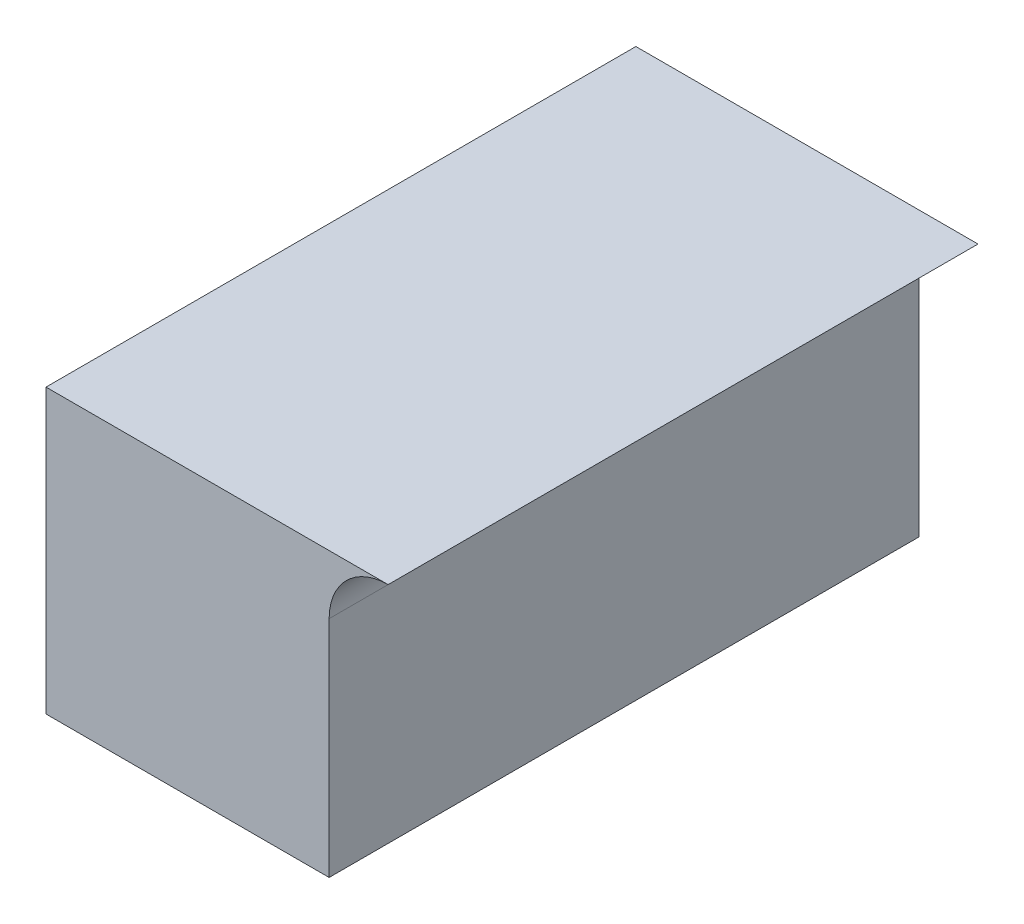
ISO-10303-21;
HEADER;
FILE_DESCRIPTION(('STEP AP214'),'2;1');
FILE_NAME('part.step','',(''),(''),'','','');
FILE_SCHEMA(('AUTOMOTIVE_DESIGN { 1 0 10303 214 1 1 1 1 }'));
ENDSEC;
DATA;
#1=APPLICATION_CONTEXT('core data for automotive mechanical design processes');
#2=APPLICATION_PROTOCOL_DEFINITION('international standard','automotive_design',2000,#1);
#3=PRODUCT_CONTEXT('',#1,'mechanical');
#4=PRODUCT('Part','Part','',(#3));
#5=PRODUCT_RELATED_PRODUCT_CATEGORY('part','',(#4));
#6=PRODUCT_DEFINITION_FORMATION('','',#4);
#7=PRODUCT_DEFINITION_CONTEXT('part definition',#1,'design');
#8=PRODUCT_DEFINITION('design','',#6,#7);
#9=PRODUCT_DEFINITION_SHAPE('','',#8);
#10=(LENGTH_UNIT() NAMED_UNIT(*) SI_UNIT(.MILLI.,.METRE.));
#11=(NAMED_UNIT(*) PLANE_ANGLE_UNIT() SI_UNIT($,.RADIAN.));
#12=(NAMED_UNIT(*) SI_UNIT($,.STERADIAN.) SOLID_ANGLE_UNIT());
#13=UNCERTAINTY_MEASURE_WITH_UNIT(LENGTH_MEASURE(1.E-05),#10,'distance_accuracy_value','');
#14=(GEOMETRIC_REPRESENTATION_CONTEXT(3) GLOBAL_UNCERTAINTY_ASSIGNED_CONTEXT((#13)) GLOBAL_UNIT_ASSIGNED_CONTEXT((#10,
#11,#12)) REPRESENTATION_CONTEXT('',''));
#15=CARTESIAN_POINT('',(0.,0.,0.));
#16=DIRECTION('',(0.,0.,1.));
#17=DIRECTION('',(1.,0.,0.));
#18=AXIS2_PLACEMENT_3D('',#15,#16,#17);
#19=CARTESIAN_POINT('',(6.,0.,12.5));
#20=DIRECTION('',(1.,0.,0.));
#21=DIRECTION('',(0.,1.,0.));
#22=AXIS2_PLACEMENT_3D('',#19,#20,#21);
#23=PLANE('',#22);
#24=DIRECTION('',(0.,-1.,0.));
#25=VECTOR('',#24,1.);
#26=CARTESIAN_POINT('',(6.,0.,-12.5));
#27=LINE('',#26,#25);
#28=CARTESIAN_POINT('',(6.,-2.5,-12.5));
#29=VERTEX_POINT('',#28);
#30=CARTESIAN_POINT('',(6.,-12.,-12.5));
#31=VERTEX_POINT('',#30);
#32=EDGE_CURVE('E119',#29,#31,#27,.T.);
#33=ORIENTED_EDGE('',*,*,#32,.F.);
#34=DIRECTION('',(0.,0.,-1.));
#35=VECTOR('',#34,1.);
#36=CARTESIAN_POINT('',(6.,-2.5,12.5));
#37=LINE('',#36,#35);
#38=CARTESIAN_POINT('',(6.,-2.5,12.5));
#39=VERTEX_POINT('',#38);
#40=EDGE_CURVE('E50',#29,#39,#37,.F.);
#41=ORIENTED_EDGE('',*,*,#40,.T.);
#42=DIRECTION('',(0.,-1.,0.));
#43=VECTOR('',#42,1.);
#44=CARTESIAN_POINT('',(6.,0.,12.5));
#45=LINE('',#44,#43);
#46=CARTESIAN_POINT('',(6.,-12.,12.5));
#47=VERTEX_POINT('',#46);
#48=EDGE_CURVE('E96',#39,#47,#45,.T.);
#49=ORIENTED_EDGE('',*,*,#48,.T.);
#50=DIRECTION('',(0.,0.,-1.));
#51=VECTOR('',#50,1.);
#52=CARTESIAN_POINT('',(6.,-12.,12.5));
#53=LINE('',#52,#51);
#54=EDGE_CURVE('E101',#47,#31,#53,.T.);
#55=ORIENTED_EDGE('',*,*,#54,.T.);
#56=EDGE_LOOP('',(#33,#41,#49,#55));
#57=FACE_BOUND('',#56,.T.);
#58=ADVANCED_FACE('F36',(#57),#23,.T.);
#59=CARTESIAN_POINT('',(-6.,-12.,12.5));
#60=DIRECTION('',(-1.,0.,0.));
#61=DIRECTION('',(0.,0.,1.));
#62=AXIS2_PLACEMENT_3D('',#59,#60,#61);
#63=PLANE('',#62);
#64=DIRECTION('',(0.,1.,0.));
#65=VECTOR('',#64,1.);
#66=CARTESIAN_POINT('',(-6.,-12.,-12.5));
#67=LINE('',#66,#65);
#68=CARTESIAN_POINT('',(-6.,-12.,-12.5));
#69=VERTEX_POINT('',#68);
#70=CARTESIAN_POINT('',(-6.,0.,-12.5));
#71=VERTEX_POINT('',#70);
#72=EDGE_CURVE('E94',#69,#71,#67,.T.);
#73=ORIENTED_EDGE('',*,*,#72,.F.);
#74=DIRECTION('',(0.,0.,-1.));
#75=VECTOR('',#74,1.);
#76=CARTESIAN_POINT('',(-6.,-12.,12.5));
#77=LINE('',#76,#75);
#78=CARTESIAN_POINT('',(-6.,-12.,12.5));
#79=VERTEX_POINT('',#78);
#80=EDGE_CURVE('E104',#79,#69,#77,.T.);
#81=ORIENTED_EDGE('',*,*,#80,.F.);
#82=DIRECTION('',(0.,1.,0.));
#83=VECTOR('',#82,1.);
#84=CARTESIAN_POINT('',(-6.,-12.,12.5));
#85=LINE('',#84,#83);
#86=CARTESIAN_POINT('',(-6.,0.,12.5));
#87=VERTEX_POINT('',#86);
#88=EDGE_CURVE('E108',#79,#87,#85,.T.);
#89=ORIENTED_EDGE('',*,*,#88,.T.);
#90=DIRECTION('',(0.,0.,-1.));
#91=VECTOR('',#90,1.);
#92=CARTESIAN_POINT('',(-6.,0.,12.5));
#93=LINE('',#92,#91);
#94=EDGE_CURVE('E89',#87,#71,#93,.T.);
#95=ORIENTED_EDGE('',*,*,#94,.T.);
#96=EDGE_LOOP('',(#73,#81,#89,#95));
#97=FACE_BOUND('',#96,.T.);
#98=ADVANCED_FACE('F126',(#97),#63,.T.);
#99=CARTESIAN_POINT('',(-6.,-12.,12.5));
#100=DIRECTION('',(0.,1.,0.));
#101=DIRECTION('',(-1.,0.,0.));
#102=AXIS2_PLACEMENT_3D('',#99,#100,#101);
#103=PLANE('',#102);
#104=DIRECTION('',(1.,0.,0.));
#105=VECTOR('',#104,1.);
#106=CARTESIAN_POINT('',(-6.,-12.,-12.5));
#107=LINE('',#106,#105);
#108=EDGE_CURVE('E116',#69,#31,#107,.T.);
#109=ORIENTED_EDGE('',*,*,#108,.T.);
#110=ORIENTED_EDGE('',*,*,#54,.F.);
#111=DIRECTION('',(1.,0.,0.));
#112=VECTOR('',#111,1.);
#113=CARTESIAN_POINT('',(-6.,-12.,12.5));
#114=LINE('',#113,#112);
#115=EDGE_CURVE('E111',#79,#47,#114,.T.);
#116=ORIENTED_EDGE('',*,*,#115,.F.);
#117=ORIENTED_EDGE('',*,*,#80,.T.);
#118=EDGE_LOOP('',(#109,#110,#116,#117));
#119=FACE_BOUND('',#118,.T.);
#120=ADVANCED_FACE('F123',(#119),#103,.F.);
#121=CARTESIAN_POINT('',(6.,-12.,12.5));
#122=DIRECTION('',(0.,0.,1.));
#123=DIRECTION('',(1.,0.,0.));
#124=AXIS2_PLACEMENT_3D('',#121,#122,#123);
#125=PLANE('',#124);
#126=ORIENTED_EDGE('',*,*,#48,.F.);
#127=CARTESIAN_POINT('',(8.5,-2.5,12.5));
#128=DIRECTION('',(0.,0.,1.));
#129=DIRECTION('',(1.,0.,0.));
#130=AXIS2_PLACEMENT_3D('',#127,#128,#129);
#131=CIRCLE('',#130,2.5);
#132=CARTESIAN_POINT('',(8.5,0.,12.5));
#133=VERTEX_POINT('',#132);
#134=EDGE_CURVE('E11',#39,#133,#131,.F.);
#135=ORIENTED_EDGE('',*,*,#134,.T.);
#136=DIRECTION('',(-1.,0.,0.));
#137=VECTOR('',#136,1.);
#138=CARTESIAN_POINT('',(6.,0.,12.5));
#139=LINE('',#138,#137);
#140=EDGE_CURVE('E86',#133,#87,#139,.T.);
#141=ORIENTED_EDGE('',*,*,#140,.T.);
#142=ORIENTED_EDGE('',*,*,#88,.F.);
#143=ORIENTED_EDGE('',*,*,#115,.T.);
#144=EDGE_LOOP('',(#126,#135,#141,#142,#143));
#145=FACE_BOUND('',#144,.T.);
#146=ADVANCED_FACE('F128',(#145),#125,.T.);
#147=CARTESIAN_POINT('',(6.,-12.,-12.5));
#148=DIRECTION('',(0.,0.,1.));
#149=DIRECTION('',(1.,0.,0.));
#150=AXIS2_PLACEMENT_3D('',#147,#148,#149);
#151=PLANE('',#150);
#152=DIRECTION('',(-1.,0.,0.));
#153=VECTOR('',#152,1.);
#154=CARTESIAN_POINT('',(6.,0.,-12.5));
#155=LINE('',#154,#153);
#156=CARTESIAN_POINT('',(8.5,0.,-12.5));
#157=VERTEX_POINT('',#156);
#158=EDGE_CURVE('E83',#157,#71,#155,.T.);
#159=ORIENTED_EDGE('',*,*,#158,.F.);
#160=CARTESIAN_POINT('',(8.5,-2.5,-12.5));
#161=DIRECTION('',(0.,0.,1.));
#162=DIRECTION('',(1.,0.,0.));
#163=AXIS2_PLACEMENT_3D('',#160,#161,#162);
#164=CIRCLE('',#163,2.5);
#165=EDGE_CURVE('E43',#157,#29,#164,.T.);
#166=ORIENTED_EDGE('',*,*,#165,.T.);
#167=ORIENTED_EDGE('',*,*,#32,.T.);
#168=ORIENTED_EDGE('',*,*,#108,.F.);
#169=ORIENTED_EDGE('',*,*,#72,.T.);
#170=EDGE_LOOP('',(#159,#166,#167,#168,#169));
#171=FACE_BOUND('',#170,.T.);
#172=ADVANCED_FACE('F91',(#171),#151,.F.);
#173=CARTESIAN_POINT('',(8.5,-2.5,25.));
#174=DIRECTION('',(0.,0.,1.));
#175=DIRECTION('',(1.,0.,0.));
#176=AXIS2_PLACEMENT_3D('',#173,#174,#175);
#177=CYLINDRICAL_SURFACE('',#176,2.5);
#178=ORIENTED_EDGE('',*,*,#134,.F.);
#179=ORIENTED_EDGE('',*,*,#40,.F.);
#180=ORIENTED_EDGE('',*,*,#165,.F.);
#181=DIRECTION('',(0.,0.,-1.));
#182=VECTOR('',#181,1.);
#183=CARTESIAN_POINT('',(8.5,0.,-12.5));
#184=LINE('',#183,#182);
#185=EDGE_CURVE('E81',#133,#157,#184,.T.);
#186=ORIENTED_EDGE('',*,*,#185,.F.);
#187=EDGE_LOOP('',(#178,#179,#180,#186));
#188=FACE_BOUND('',#187,.T.);
#189=ADVANCED_FACE('F98',(#188),#177,.F.);
#190=CARTESIAN_POINT('',(-25.,0.,25.));
#191=DIRECTION('',(0.,-1.,0.));
#192=DIRECTION('',(0.,0.,-1.));
#193=AXIS2_PLACEMENT_3D('',#190,#191,#192);
#194=PLANE('',#193);
#195=ORIENTED_EDGE('',*,*,#94,.F.);
#196=ORIENTED_EDGE('',*,*,#140,.F.);
#197=ORIENTED_EDGE('',*,*,#185,.T.);
#198=ORIENTED_EDGE('',*,*,#158,.T.);
#199=EDGE_LOOP('',(#195,#196,#197,#198));
#200=FACE_BOUND('',#199,.T.);
#201=ADVANCED_FACE('F82',(#200),#194,.F.);
#202=CLOSED_SHELL('',(#58,#98,#120,#146,#172,#189,#201));
#203=MANIFOLD_SOLID_BREP('B2',#202);
#204=ADVANCED_BREP_SHAPE_REPRESENTATION('',(#18,#203),#14);
#205=SHAPE_DEFINITION_REPRESENTATION(#9,#204);
ENDSEC;
END-ISO-10303-21;
